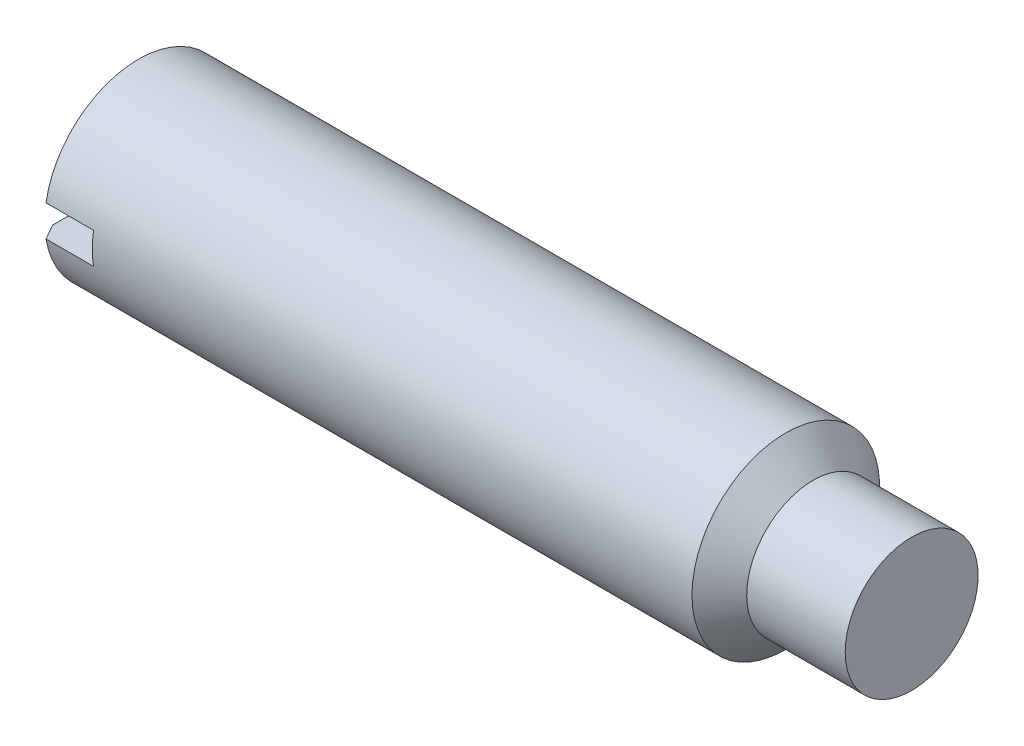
ISO-10303-21;
HEADER;
FILE_DESCRIPTION(('STEP AP214'),'2;1');
FILE_NAME('part.step','',(''),(''),'','','');
FILE_SCHEMA(('AUTOMOTIVE_DESIGN { 1 0 10303 214 1 1 1 1 }'));
ENDSEC;
DATA;
#1=APPLICATION_CONTEXT('core data for automotive mechanical design processes');
#2=APPLICATION_PROTOCOL_DEFINITION('international standard','automotive_design',2000,#1);
#3=PRODUCT_CONTEXT('',#1,'mechanical');
#4=PRODUCT('Part','Part','',(#3));
#5=PRODUCT_RELATED_PRODUCT_CATEGORY('part','',(#4));
#6=PRODUCT_DEFINITION_FORMATION('','',#4);
#7=PRODUCT_DEFINITION_CONTEXT('part definition',#1,'design');
#8=PRODUCT_DEFINITION('design','',#6,#7);
#9=PRODUCT_DEFINITION_SHAPE('','',#8);
#10=(LENGTH_UNIT() NAMED_UNIT(*) SI_UNIT(.MILLI.,.METRE.));
#11=(NAMED_UNIT(*) PLANE_ANGLE_UNIT() SI_UNIT($,.RADIAN.));
#12=(NAMED_UNIT(*) SI_UNIT($,.STERADIAN.) SOLID_ANGLE_UNIT());
#13=UNCERTAINTY_MEASURE_WITH_UNIT(LENGTH_MEASURE(1.E-05),#10,'distance_accuracy_value','');
#14=(GEOMETRIC_REPRESENTATION_CONTEXT(3) GLOBAL_UNCERTAINTY_ASSIGNED_CONTEXT((#13)) GLOBAL_UNIT_ASSIGNED_CONTEXT((#10,
#11,#12)) REPRESENTATION_CONTEXT('',''));
#15=CARTESIAN_POINT('',(0.,0.,0.));
#16=DIRECTION('',(0.,0.,1.));
#17=DIRECTION('',(1.,0.,0.));
#18=AXIS2_PLACEMENT_3D('',#15,#16,#17);
#19=CARTESIAN_POINT('',(0.,0.,0.));
#20=DIRECTION('',(-1.,0.,0.));
#21=DIRECTION('',(0.,0.,1.));
#22=AXIS2_PLACEMENT_3D('',#19,#20,#21);
#23=PLANE('',#22);
#24=CARTESIAN_POINT('',(0.,0.,0.));
#25=DIRECTION('',(-1.,0.,0.));
#26=DIRECTION('',(0.,0.,1.));
#27=AXIS2_PLACEMENT_3D('',#24,#25,#26);
#28=CIRCLE('',#27,5.036);
#29=CARTESIAN_POINT('',(0.,1.,4.93571636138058));
#30=VERTEX_POINT('',#29);
#31=CARTESIAN_POINT('',(0.,1.,-4.93571636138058));
#32=VERTEX_POINT('',#31);
#33=EDGE_CURVE('E114',#30,#32,#28,.T.);
#34=ORIENTED_EDGE('',*,*,#33,.T.);
#35=DIRECTION('',(0.,0.,1.));
#36=VECTOR('',#35,1.);
#37=CARTESIAN_POINT('',(0.,1.,-6.));
#38=LINE('',#37,#36);
#39=EDGE_CURVE('E188',#32,#30,#38,.T.);
#40=ORIENTED_EDGE('',*,*,#39,.T.);
#41=EDGE_LOOP('',(#34,#40));
#42=FACE_BOUND('',#41,.T.);
#43=ADVANCED_FACE('F41',(#42),#23,.T.);
#44=CARTESIAN_POINT('',(0.,-0.999999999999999,-4.93571636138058));
#45=VERTEX_POINT('',#44);
#46=CARTESIAN_POINT('',(0.,-1.,4.93571636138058));
#47=VERTEX_POINT('',#46);
#48=EDGE_CURVE('E110',#45,#47,#28,.T.);
#49=ORIENTED_EDGE('',*,*,#48,.T.);
#50=DIRECTION('',(0.,0.,-1.));
#51=VECTOR('',#50,1.);
#52=CARTESIAN_POINT('',(0.,-0.999999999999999,-6.));
#53=LINE('',#52,#51);
#54=EDGE_CURVE('E102',#47,#45,#53,.T.);
#55=ORIENTED_EDGE('',*,*,#54,.T.);
#56=EDGE_LOOP('',(#49,#55));
#57=FACE_BOUND('',#56,.T.);
#58=ADVANCED_FACE('F180',(#57),#23,.T.);
#59=CARTESIAN_POINT('',(0.,0.,0.));
#60=DIRECTION('',(1.,0.,0.));
#61=DIRECTION('',(0.,0.,-1.));
#62=AXIS2_PLACEMENT_3D('',#59,#60,#61);
#63=CONICAL_SURFACE('',#62,5.036,1.0471975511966);
#64=CARTESIAN_POINT('',(0.556565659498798,0.,0.));
#65=DIRECTION('',(-1.,0.,0.));
#66=DIRECTION('',(0.,0.,1.));
#67=AXIS2_PLACEMENT_3D('',#64,#65,#66);
#68=CIRCLE('',#67,6.);
#69=CARTESIAN_POINT('',(0.556565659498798,0.999999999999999,5.91607978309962));
#70=VERTEX_POINT('',#69);
#71=CARTESIAN_POINT('',(0.556565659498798,1.,-5.91607978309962));
#72=VERTEX_POINT('',#71);
#73=EDGE_CURVE('E107',#70,#72,#68,.T.);
#74=ORIENTED_EDGE('',*,*,#73,.T.);
#75=CARTESIAN_POINT('',(4.73989669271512,1.,-13.2079399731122));
#76=CARTESIAN_POINT('',(4.41853771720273,1.,-12.649708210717));
#77=CARTESIAN_POINT('',(4.09724308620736,1.,-12.0914392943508));
#78=CARTESIAN_POINT('',(3.45491866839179,1.,-10.9747439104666));
#79=CARTESIAN_POINT('',(3.13388888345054,1.,-10.416317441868));
#80=CARTESIAN_POINT('',(2.49197762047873,1.,-9.29878375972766));
#81=CARTESIAN_POINT('',(2.17109646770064,1.,-8.73967635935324));
#82=CARTESIAN_POINT('',(1.53002759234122,1.,-7.62106803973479));
#83=CARTESIAN_POINT('',(1.20983986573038,1.,-7.06156712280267));
#84=CARTESIAN_POINT('',(0.731752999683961,1.,-6.22374471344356));
#85=CARTESIAN_POINT('',(0.573331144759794,1.,-5.94572157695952));
#86=CARTESIAN_POINT('',(0.257006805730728,1.,-5.38937510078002));
#87=CARTESIAN_POINT('',(0.0991043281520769,1.,-5.11105175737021));
#88=CARTESIAN_POINT('',(-0.215803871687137,1.,-4.55405780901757));
#89=CARTESIAN_POINT('',(-0.37280995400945,1.,-4.27538740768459));
#90=CARTESIAN_POINT('',(-0.685421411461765,1.,-3.71727146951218));
#91=CARTESIAN_POINT('',(-0.841026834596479,1.,-3.4378259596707));
#92=CARTESIAN_POINT('',(-1.07280047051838,1.,-3.01670739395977));
#93=CARTESIAN_POINT('',(-1.15000341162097,1.,-2.87560489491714));
#94=CARTESIAN_POINT('',(-1.30334590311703,1.,-2.59280771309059));
#95=CARTESIAN_POINT('',(-1.37948536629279,1.,-2.45111298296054));
#96=CARTESIAN_POINT('',(-1.53019389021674,1.,-2.16666998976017));
#97=CARTESIAN_POINT('',(-1.60476099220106,1.,-2.02392068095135));
#98=CARTESIAN_POINT('',(-1.71445658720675,1.,-1.80870871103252));
#99=CARTESIAN_POINT('',(-1.75066016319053,1.,-1.73679509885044));
#100=CARTESIAN_POINT('',(-1.82208482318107,1.,-1.5924826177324));
#101=CARTESIAN_POINT('',(-1.85730593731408,1.,-1.52008376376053));
#102=CARTESIAN_POINT('',(-1.92735529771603,1.,-1.37261463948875));
#103=CARTESIAN_POINT('',(-1.96214530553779,1.,-1.2975261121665));
#104=CARTESIAN_POINT('',(-2.02965956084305,1.,-1.14642727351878));
#105=CARTESIAN_POINT('',(-2.06238404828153,1.,-1.07041707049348));
#106=CARTESIAN_POINT('',(-2.12476431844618,1.,-0.917145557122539));
#107=CARTESIAN_POINT('',(-2.15442052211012,1.,-0.839884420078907));
#108=CARTESIAN_POINT('',(-2.2090625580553,1.,-0.683706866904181));
#109=CARTESIAN_POINT('',(-2.23405029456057,1.,-0.604791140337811));
#110=CARTESIAN_POINT('',(-2.27018581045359,1.,-0.470093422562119));
#111=CARTESIAN_POINT('',(-2.28321589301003,1.,-0.414824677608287));
#112=CARTESIAN_POINT('',(-2.30494623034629,1.,-0.303453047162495));
#113=CARTESIAN_POINT('',(-2.31364920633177,1.,-0.24735070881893));
#114=CARTESIAN_POINT('',(-2.32581520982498,1.,-0.134957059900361));
#115=CARTESIAN_POINT('',(-2.3293144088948,1.,-0.0786698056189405));
#116=CARTESIAN_POINT('',(-2.33076867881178,1.,0.0339758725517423));
#117=CARTESIAN_POINT('',(-2.32872385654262,1.,0.0903342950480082));
#118=CARTESIAN_POINT('',(-2.31805799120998,1.,0.217768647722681));
#119=CARTESIAN_POINT('',(-2.30780921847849,1.,0.288706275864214));
#120=CARTESIAN_POINT('',(-2.28041448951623,1.,0.429255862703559));
#121=CARTESIAN_POINT('',(-2.26326048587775,1.,0.498866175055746));
#122=CARTESIAN_POINT('',(-2.23367324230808,1.,0.602653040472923));
#123=CARTESIAN_POINT('',(-2.22308279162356,1.,0.6373773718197));
#124=CARTESIAN_POINT('',(-2.20083833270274,1.,0.706460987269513));
#125=CARTESIAN_POINT('',(-2.18918499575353,1.,0.740820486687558));
#126=CARTESIAN_POINT('',(-2.16499431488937,1.,0.809218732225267));
#127=CARTESIAN_POINT('',(-2.15245710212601,1.,0.843257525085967));
#128=CARTESIAN_POINT('',(-2.12664333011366,1.,0.911058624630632));
#129=CARTESIAN_POINT('',(-2.11336665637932,1.,0.944820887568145));
#130=CARTESIAN_POINT('',(-2.06998388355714,1.,1.05227293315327));
#131=CARTESIAN_POINT('',(-2.03871498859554,1.,1.12549298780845));
#132=CARTESIAN_POINT('',(-1.97418773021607,1.,1.27105481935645));
#133=CARTESIAN_POINT('',(-1.94092900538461,1.,1.34339643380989));
#134=CARTESIAN_POINT('',(-1.87300145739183,1.,1.48745172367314));
#135=CARTESIAN_POINT('',(-1.83833201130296,1.,1.55916510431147));
#136=CARTESIAN_POINT('',(-1.76798292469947,1.,1.70209571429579));
#137=CARTESIAN_POINT('',(-1.73230324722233,1.,1.77331292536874));
#138=CARTESIAN_POINT('',(-1.62404833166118,1.,1.98662313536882));
#139=CARTESIAN_POINT('',(-1.55036430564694,1.,2.1281523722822));
#140=CARTESIAN_POINT('',(-1.40130813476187,1.,2.41025810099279));
#141=CARTESIAN_POINT('',(-1.32593649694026,1.,2.55083486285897));
#142=CARTESIAN_POINT('',(-1.17450983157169,1.,2.83063597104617));
#143=CARTESIAN_POINT('',(-1.09846071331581,1.,2.96986351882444));
#144=CARTESIAN_POINT('',(-0.945628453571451,1.,3.24792809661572));
#145=CARTESIAN_POINT('',(-0.868845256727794,1.,3.38676509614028));
#146=CARTESIAN_POINT('',(-0.637891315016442,1.,3.80258527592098));
#147=CARTESIAN_POINT('',(-0.482967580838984,1.,4.07914988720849));
#148=CARTESIAN_POINT('',(-0.119566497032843,1.,4.72494312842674));
#149=CARTESIAN_POINT('',(0.0893330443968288,0.999999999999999,5.09393352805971));
#150=CARTESIAN_POINT('',(0.508131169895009,0.999999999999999,5.83135176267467));
#151=CARTESIAN_POINT('',(0.718029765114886,0.999999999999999,6.19977959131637));
#152=CARTESIAN_POINT('',(1.13850339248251,0.999999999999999,6.93645171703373));
#153=CARTESIAN_POINT('',(1.34907866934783,0.999999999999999,7.30469587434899));
#154=CARTESIAN_POINT('',(1.77060223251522,0.999999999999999,8.0409687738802));
#155=CARTESIAN_POINT('',(1.98155051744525,0.999999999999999,8.40899751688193));
#156=CARTESIAN_POINT('',(2.40459995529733,0.999999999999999,9.14648067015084));
#157=CARTESIAN_POINT('',(2.61670218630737,0.999999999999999,9.51593446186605));
#158=CARTESIAN_POINT('',(3.04108596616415,0.999999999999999,10.2547396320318));
#159=CARTESIAN_POINT('',(3.25336751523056,0.999999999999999,10.6240910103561));
#160=CARTESIAN_POINT('',(3.67796813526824,0.999999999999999,11.3625576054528));
#161=CARTESIAN_POINT('',(3.8902871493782,0.999999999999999,11.7316728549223));
#162=CARTESIAN_POINT('',(4.3150247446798,0.999999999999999,12.4698454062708));
#163=CARTESIAN_POINT('',(4.52744332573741,0.999999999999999,12.8389027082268));
#164=CARTESIAN_POINT('',(4.73989669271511,0.999999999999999,13.2079399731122));
#165=B_SPLINE_CURVE_WITH_KNOTS('',3,(#75,#76,#77,#78,#79,#80,#81,#82,#83,#84,#85,#86,#87,#88,
#89,#90,#91,#92,#93,#94,#95,#96,#97,#98,#99,#100,#101,#102,#103,#104,#105,#106,#107,#108,#109,
#110,#111,#112,#113,#114,#115,#116,#117,#118,#119,#120,#121,#122,#123,#124,#125,#126,#127,#128,
#129,#130,#131,#132,#133,#134,#135,#136,#137,#138,#139,#140,#141,#142,#143,#144,#145,#146,#147,
#148,#149,#150,#151,#152,#153,#154,#155,#156,#157,#158,#159,#160,#161,#162,#163,#164),
.UNSPECIFIED.,.F.,.F.,(4,2,2,2,2,2,2,2,2,2,2,2,2,2,2,2,2,2,2,2,2,2,2,2,2,2,2,2,2,2,2,2,2,2,2,2,
2,2,2,2,2,2,2,2,4),(0.,1.93236881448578,3.86475122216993,5.79868288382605,7.73260327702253,
8.69257649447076,9.6525617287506,10.612129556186,11.5716643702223,12.054187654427,
12.5367502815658,13.0198822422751,13.2614145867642,13.5029395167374,13.7511887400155,
13.9994090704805,14.2475953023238,14.4956800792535,14.6658994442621,14.8360116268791,
15.0049357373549,15.1738565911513,15.3884236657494,15.6032415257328,15.7121389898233,
15.8209681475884,15.9297811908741,16.0386111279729,16.2774120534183,16.5162564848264,
16.7552075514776,16.9941673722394,17.4728272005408,17.9513450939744,18.4272722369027,
18.9032355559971,19.854231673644,21.1262890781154,22.3983607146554,23.6709606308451,
24.9435558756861,26.2215820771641,27.4996098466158,28.7770795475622,30.0545475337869),.UNSPECIFIED.);
#166=EDGE_CURVE('E135',#72,#32,#165,.T.);
#167=ORIENTED_EDGE('',*,*,#166,.T.);
#168=ORIENTED_EDGE('',*,*,#33,.F.);
#169=EDGE_CURVE('E137',#30,#70,#165,.T.);
#170=ORIENTED_EDGE('',*,*,#169,.T.);
#171=EDGE_LOOP('',(#74,#167,#168,#170));
#172=FACE_BOUND('',#171,.T.);
#173=ADVANCED_FACE('F152',(#172),#63,.T.);
#174=CARTESIAN_POINT('',(0.556565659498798,-0.999999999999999,-5.91607978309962));
#175=VERTEX_POINT('',#174);
#176=CARTESIAN_POINT('',(0.556565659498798,-1.,5.91607978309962));
#177=VERTEX_POINT('',#176);
#178=EDGE_CURVE('E111',#175,#177,#68,.T.);
#179=ORIENTED_EDGE('',*,*,#178,.T.);
#180=CARTESIAN_POINT('',(4.73989669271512,-1.,13.2079399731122));
#181=CARTESIAN_POINT('',(4.41853771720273,-1.,12.649708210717));
#182=CARTESIAN_POINT('',(4.09724308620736,-1.,12.0914392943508));
#183=CARTESIAN_POINT('',(3.45491866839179,-1.,10.9747439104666));
#184=CARTESIAN_POINT('',(3.13388888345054,-1.,10.416317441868));
#185=CARTESIAN_POINT('',(2.49197762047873,-1.,9.29878375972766));
#186=CARTESIAN_POINT('',(2.17109646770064,-1.,8.73967635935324));
#187=CARTESIAN_POINT('',(1.53002759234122,-1.,7.62106803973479));
#188=CARTESIAN_POINT('',(1.20983986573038,-1.,7.06156712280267));
#189=CARTESIAN_POINT('',(0.731752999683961,-1.,6.22374471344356));
#190=CARTESIAN_POINT('',(0.573331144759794,-1.,5.94572157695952));
#191=CARTESIAN_POINT('',(0.257006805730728,-1.,5.38937510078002));
#192=CARTESIAN_POINT('',(0.0991043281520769,-1.,5.11105175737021));
#193=CARTESIAN_POINT('',(-0.215803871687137,-1.,4.55405780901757));
#194=CARTESIAN_POINT('',(-0.37280995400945,-1.,4.27538740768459));
#195=CARTESIAN_POINT('',(-0.685421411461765,-1.,3.71727146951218));
#196=CARTESIAN_POINT('',(-0.841026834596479,-1.,3.4378259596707));
#197=CARTESIAN_POINT('',(-1.07280047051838,-1.,3.01670739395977));
#198=CARTESIAN_POINT('',(-1.15000341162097,-1.,2.87560489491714));
#199=CARTESIAN_POINT('',(-1.30334590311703,-1.,2.59280771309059));
#200=CARTESIAN_POINT('',(-1.37948536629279,-1.,2.45111298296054));
#201=CARTESIAN_POINT('',(-1.53019389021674,-1.,2.16666998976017));
#202=CARTESIAN_POINT('',(-1.60476099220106,-1.,2.02392068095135));
#203=CARTESIAN_POINT('',(-1.71445658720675,-1.,1.80870871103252));
#204=CARTESIAN_POINT('',(-1.75066016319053,-1.,1.73679509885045));
#205=CARTESIAN_POINT('',(-1.82208482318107,-1.,1.5924826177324));
#206=CARTESIAN_POINT('',(-1.85730593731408,-1.,1.52008376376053));
#207=CARTESIAN_POINT('',(-1.92735529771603,-1.,1.37261463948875));
#208=CARTESIAN_POINT('',(-1.96214530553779,-1.,1.2975261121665));
#209=CARTESIAN_POINT('',(-2.02965956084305,-1.,1.14642727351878));
#210=CARTESIAN_POINT('',(-2.06238404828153,-1.,1.07041707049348));
#211=CARTESIAN_POINT('',(-2.12476431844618,-1.,0.917145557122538));
#212=CARTESIAN_POINT('',(-2.15442052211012,-1.,0.839884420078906));
#213=CARTESIAN_POINT('',(-2.2090625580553,-1.,0.68370686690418));
#214=CARTESIAN_POINT('',(-2.23405029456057,-1.,0.604791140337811));
#215=CARTESIAN_POINT('',(-2.27018581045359,-1.,0.470093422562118));
#216=CARTESIAN_POINT('',(-2.28321589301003,-1.,0.414824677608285));
#217=CARTESIAN_POINT('',(-2.30494623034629,-1.,0.303453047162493));
#218=CARTESIAN_POINT('',(-2.31364920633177,-1.,0.247350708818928));
#219=CARTESIAN_POINT('',(-2.32581520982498,-1.,0.13495705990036));
#220=CARTESIAN_POINT('',(-2.3293144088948,-1.,0.0786698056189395));
#221=CARTESIAN_POINT('',(-2.33076867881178,-1.,-0.0339758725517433));
#222=CARTESIAN_POINT('',(-2.32872385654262,-1.,-0.0903342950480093));
#223=CARTESIAN_POINT('',(-2.31805799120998,-1.,-0.217768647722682));
#224=CARTESIAN_POINT('',(-2.30780921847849,-1.,-0.288706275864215));
#225=CARTESIAN_POINT('',(-2.28041448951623,-1.,-0.42925586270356));
#226=CARTESIAN_POINT('',(-2.26326048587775,-1.,-0.498866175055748));
#227=CARTESIAN_POINT('',(-2.23367324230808,-1.,-0.602653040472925));
#228=CARTESIAN_POINT('',(-2.22308279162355,-1.,-0.637377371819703));
#229=CARTESIAN_POINT('',(-2.20083833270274,-1.,-0.706460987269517));
#230=CARTESIAN_POINT('',(-2.18918499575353,-1.,-0.740820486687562));
#231=CARTESIAN_POINT('',(-2.16499431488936,-1.,-0.809218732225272));
#232=CARTESIAN_POINT('',(-2.15245710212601,-1.,-0.843257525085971));
#233=CARTESIAN_POINT('',(-2.12664333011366,-1.,-0.911058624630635));
#234=CARTESIAN_POINT('',(-2.11336665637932,-1.,-0.944820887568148));
#235=CARTESIAN_POINT('',(-2.06998388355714,-1.,-1.05227293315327));
#236=CARTESIAN_POINT('',(-2.03871498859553,-1.,-1.12549298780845));
#237=CARTESIAN_POINT('',(-1.97418773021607,-1.,-1.27105481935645));
#238=CARTESIAN_POINT('',(-1.94092900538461,-1.,-1.34339643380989));
#239=CARTESIAN_POINT('',(-1.87300145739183,-1.,-1.48745172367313));
#240=CARTESIAN_POINT('',(-1.83833201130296,-1.,-1.55916510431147));
#241=CARTESIAN_POINT('',(-1.76798292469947,-1.,-1.70209571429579));
#242=CARTESIAN_POINT('',(-1.73230324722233,-1.,-1.77331292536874));
#243=CARTESIAN_POINT('',(-1.62404833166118,-1.,-1.98662313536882));
#244=CARTESIAN_POINT('',(-1.55036430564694,-1.,-2.1281523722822));
#245=CARTESIAN_POINT('',(-1.40130813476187,-1.,-2.41025810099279));
#246=CARTESIAN_POINT('',(-1.32593649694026,-1.,-2.55083486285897));
#247=CARTESIAN_POINT('',(-1.17450983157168,-1.,-2.83063597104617));
#248=CARTESIAN_POINT('',(-1.09846071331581,-1.,-2.96986351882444));
#249=CARTESIAN_POINT('',(-0.945628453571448,-1.,-3.24792809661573));
#250=CARTESIAN_POINT('',(-0.868845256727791,-1.,-3.38676509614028));
#251=CARTESIAN_POINT('',(-0.637891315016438,-0.999999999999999,-3.80258527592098));
#252=CARTESIAN_POINT('',(-0.48296758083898,-1.,-4.0791498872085));
#253=CARTESIAN_POINT('',(-0.119566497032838,-1.,-4.72494312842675));
#254=CARTESIAN_POINT('',(0.0893330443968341,-0.999999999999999,-5.09393352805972));
#255=CARTESIAN_POINT('',(0.508131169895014,-0.999999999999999,-5.83135176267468));
#256=CARTESIAN_POINT('',(0.718029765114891,-0.999999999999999,-6.19977959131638));
#257=CARTESIAN_POINT('',(1.13850339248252,-0.999999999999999,-6.93645171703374));
#258=CARTESIAN_POINT('',(1.34907866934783,-0.999999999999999,-7.30469587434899));
#259=CARTESIAN_POINT('',(1.77060223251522,-0.999999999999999,-8.04096877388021));
#260=CARTESIAN_POINT('',(1.98155051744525,-0.999999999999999,-8.40899751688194));
#261=CARTESIAN_POINT('',(2.40459995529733,-0.999999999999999,-9.14648067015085));
#262=CARTESIAN_POINT('',(2.61670218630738,-0.999999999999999,-9.51593446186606));
#263=CARTESIAN_POINT('',(3.04108596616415,-0.999999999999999,-10.2547396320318));
#264=CARTESIAN_POINT('',(3.25336751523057,-0.999999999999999,-10.6240910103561));
#265=CARTESIAN_POINT('',(3.67796813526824,-0.999999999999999,-11.3625576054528));
#266=CARTESIAN_POINT('',(3.8902871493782,-0.999999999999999,-11.7316728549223));
#267=CARTESIAN_POINT('',(4.31502474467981,-0.999999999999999,-12.4698454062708));
#268=CARTESIAN_POINT('',(4.52744332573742,-0.999999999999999,-12.8389027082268));
#269=CARTESIAN_POINT('',(4.73989669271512,-0.999999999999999,-13.2079399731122));
#270=B_SPLINE_CURVE_WITH_KNOTS('',3,(#180,#181,#182,#183,#184,#185,#186,#187,#188,#189,#190,
#191,#192,#193,#194,#195,#196,#197,#198,#199,#200,#201,#202,#203,#204,#205,#206,#207,#208,#209,
#210,#211,#212,#213,#214,#215,#216,#217,#218,#219,#220,#221,#222,#223,#224,#225,#226,#227,#228,
#229,#230,#231,#232,#233,#234,#235,#236,#237,#238,#239,#240,#241,#242,#243,#244,#245,#246,#247,
#248,#249,#250,#251,#252,#253,#254,#255,#256,#257,#258,#259,#260,#261,#262,#263,#264,#265,#266,
#267,#268,#269),.UNSPECIFIED.,.F.,.F.,(4,2,2,2,2,2,2,2,2,2,2,2,2,2,2,2,2,2,2,2,2,2,2,2,2,2,2,2,
2,2,2,2,2,2,2,2,2,2,2,2,2,2,2,2,4),(0.,1.93236881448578,3.86475122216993,5.79868288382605,
7.73260327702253,8.69257649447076,9.6525617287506,10.612129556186,11.5716643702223,
12.054187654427,12.5367502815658,13.0198822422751,13.2614145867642,13.5029395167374,
13.7511887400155,13.9994090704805,14.2475953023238,14.4956800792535,14.6658994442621,
14.8360116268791,15.0049357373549,15.1738565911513,15.3884236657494,15.6032415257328,
15.7121389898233,15.8209681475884,15.9297811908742,16.0386111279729,16.2774120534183,
16.5162564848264,16.7552075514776,16.9941673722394,17.4728272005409,17.9513450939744,
18.4272722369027,18.9032355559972,19.8542316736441,21.1262890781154,22.3983607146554,
23.6709606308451,24.9435558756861,26.2215820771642,27.4996098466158,28.7770795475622,
30.0545475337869),.UNSPECIFIED.);
#271=EDGE_CURVE('E132',#177,#47,#270,.T.);
#272=ORIENTED_EDGE('',*,*,#271,.T.);
#273=ORIENTED_EDGE('',*,*,#48,.F.);
#274=EDGE_CURVE('E133',#45,#175,#270,.T.);
#275=ORIENTED_EDGE('',*,*,#274,.T.);
#276=EDGE_LOOP('',(#179,#272,#273,#275));
#277=FACE_BOUND('',#276,.T.);
#278=ADVANCED_FACE('F130',(#277),#63,.T.);
#279=CARTESIAN_POINT('',(-12.7,0.,0.));
#280=DIRECTION('',(-1.,0.,0.));
#281=DIRECTION('',(0.,0.,1.));
#282=AXIS2_PLACEMENT_3D('',#279,#280,#281);
#283=CYLINDRICAL_SURFACE('',#282,6.);
#284=CARTESIAN_POINT('',(41.95,0.,0.));
#285=DIRECTION('',(-1.,0.,0.));
#286=DIRECTION('',(0.,0.,1.));
#287=AXIS2_PLACEMENT_3D('',#284,#285,#286);
#288=CIRCLE('',#287,6.);
#289=CARTESIAN_POINT('',(41.95,0.,6.));
#290=VERTEX_POINT('',#289);
#291=EDGE_CURVE('E117',#290,#290,#288,.T.);
#292=ORIENTED_EDGE('',*,*,#291,.T.);
#293=EDGE_LOOP('',(#292));
#294=FACE_BOUND('',#293,.T.);
#295=ORIENTED_EDGE('',*,*,#73,.F.);
#296=DIRECTION('',(-1.,0.,0.));
#297=VECTOR('',#296,1.);
#298=CARTESIAN_POINT('',(-12.7,0.999999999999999,5.91607978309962));
#299=LINE('',#298,#297);
#300=CARTESIAN_POINT('',(3.6,0.999999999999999,5.91607978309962));
#301=VERTEX_POINT('',#300);
#302=EDGE_CURVE('E11',#70,#301,#299,.F.);
#303=ORIENTED_EDGE('',*,*,#302,.T.);
#304=CARTESIAN_POINT('',(3.6,0.,0.));
#305=DIRECTION('',(1.,0.,0.));
#306=DIRECTION('',(0.,0.,-1.));
#307=AXIS2_PLACEMENT_3D('',#304,#305,#306);
#308=CIRCLE('',#307,6.);
#309=CARTESIAN_POINT('',(3.6,-1.,5.91607978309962));
#310=VERTEX_POINT('',#309);
#311=EDGE_CURVE('E89',#310,#301,#308,.F.);
#312=ORIENTED_EDGE('',*,*,#311,.F.);
#313=DIRECTION('',(-1.,0.,0.));
#314=VECTOR('',#313,1.);
#315=CARTESIAN_POINT('',(-12.7,-1.,5.91607978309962));
#316=LINE('',#315,#314);
#317=EDGE_CURVE('E48',#310,#177,#316,.T.);
#318=ORIENTED_EDGE('',*,*,#317,.T.);
#319=ORIENTED_EDGE('',*,*,#178,.F.);
#320=DIRECTION('',(-1.,0.,0.));
#321=VECTOR('',#320,1.);
#322=CARTESIAN_POINT('',(-12.7,-0.999999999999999,-5.91607978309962));
#323=LINE('',#322,#321);
#324=CARTESIAN_POINT('',(3.6,-0.999999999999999,-5.91607978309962));
#325=VERTEX_POINT('',#324);
#326=EDGE_CURVE('E122',#175,#325,#323,.F.);
#327=ORIENTED_EDGE('',*,*,#326,.T.);
#328=CARTESIAN_POINT('',(3.6,1.,-5.91607978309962));
#329=VERTEX_POINT('',#328);
#330=EDGE_CURVE('E98',#329,#325,#308,.F.);
#331=ORIENTED_EDGE('',*,*,#330,.F.);
#332=DIRECTION('',(-1.,0.,0.));
#333=VECTOR('',#332,1.);
#334=CARTESIAN_POINT('',(-12.7,1.,-5.91607978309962));
#335=LINE('',#334,#333);
#336=EDGE_CURVE('E96',#329,#72,#335,.T.);
#337=ORIENTED_EDGE('',*,*,#336,.T.);
#338=EDGE_LOOP('',(#295,#303,#312,#318,#319,#327,#331,#337));
#339=FACE_BOUND('',#338,.T.);
#340=ADVANCED_FACE('F105',(#294,#339),#283,.T.);
#341=CARTESIAN_POINT('',(43.7,0.,0.));
#342=DIRECTION('',(-1.,0.,0.));
#343=DIRECTION('',(0.,0.,1.));
#344=AXIS2_PLACEMENT_3D('',#341,#342,#343);
#345=CONICAL_SURFACE('',#344,4.25,0.785398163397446);
#346=ORIENTED_EDGE('',*,*,#291,.F.);
#347=EDGE_LOOP('',(#346));
#348=FACE_BOUND('',#347,.T.);
#349=CARTESIAN_POINT('',(43.7,0.,0.));
#350=DIRECTION('',(-1.,0.,0.));
#351=DIRECTION('',(0.,0.,1.));
#352=AXIS2_PLACEMENT_3D('',#349,#350,#351);
#353=CIRCLE('',#352,4.25);
#354=CARTESIAN_POINT('',(43.7,0.,4.25));
#355=VERTEX_POINT('',#354);
#356=EDGE_CURVE('E192',#355,#355,#353,.T.);
#357=ORIENTED_EDGE('',*,*,#356,.T.);
#358=EDGE_LOOP('',(#357));
#359=FACE_BOUND('',#358,.T.);
#360=ADVANCED_FACE('F169',(#348,#359),#345,.T.);
#361=CARTESIAN_POINT('',(-12.7,0.,0.));
#362=DIRECTION('',(-1.,0.,0.));
#363=DIRECTION('',(0.,0.,1.));
#364=AXIS2_PLACEMENT_3D('',#361,#362,#363);
#365=CYLINDRICAL_SURFACE('',#364,4.25);
#366=CARTESIAN_POINT('',(50.,0.,0.));
#367=DIRECTION('',(-1.,0.,0.));
#368=DIRECTION('',(0.,0.,1.));
#369=AXIS2_PLACEMENT_3D('',#366,#367,#368);
#370=CIRCLE('',#369,4.25);
#371=CARTESIAN_POINT('',(50.,0.,4.25));
#372=VERTEX_POINT('',#371);
#373=EDGE_CURVE('E190',#372,#372,#370,.T.);
#374=ORIENTED_EDGE('',*,*,#373,.T.);
#375=EDGE_LOOP('',(#374));
#376=FACE_BOUND('',#375,.T.);
#377=ORIENTED_EDGE('',*,*,#356,.F.);
#378=EDGE_LOOP('',(#377));
#379=FACE_BOUND('',#378,.T.);
#380=ADVANCED_FACE('F165',(#376,#379),#365,.T.);
#381=CARTESIAN_POINT('',(50.,4.25,0.));
#382=DIRECTION('',(1.,0.,0.));
#383=DIRECTION('',(0.,0.,-1.));
#384=AXIS2_PLACEMENT_3D('',#381,#382,#383);
#385=PLANE('',#384);
#386=ORIENTED_EDGE('',*,*,#373,.F.);
#387=EDGE_LOOP('',(#386));
#388=FACE_BOUND('',#387,.T.);
#389=ADVANCED_FACE('F162',(#388),#385,.T.);
#390=CARTESIAN_POINT('',(3.6,1.,-6.));
#391=DIRECTION('',(0.,-1.,0.));
#392=DIRECTION('',(0.,0.,-1.));
#393=AXIS2_PLACEMENT_3D('',#390,#391,#392);
#394=PLANE('',#393);
#395=ORIENTED_EDGE('',*,*,#39,.F.);
#396=ORIENTED_EDGE('',*,*,#166,.F.);
#397=ORIENTED_EDGE('',*,*,#336,.F.);
#398=DIRECTION('',(0.,0.,1.));
#399=VECTOR('',#398,1.);
#400=CARTESIAN_POINT('',(3.6,1.,-6.));
#401=LINE('',#400,#399);
#402=EDGE_CURVE('E55',#329,#301,#401,.T.);
#403=ORIENTED_EDGE('',*,*,#402,.T.);
#404=ORIENTED_EDGE('',*,*,#302,.F.);
#405=ORIENTED_EDGE('',*,*,#169,.F.);
#406=EDGE_LOOP('',(#395,#396,#397,#403,#404,#405));
#407=FACE_BOUND('',#406,.T.);
#408=ADVANCED_FACE('F99',(#407),#394,.T.);
#409=CARTESIAN_POINT('',(3.6,-0.999999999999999,-6.));
#410=DIRECTION('',(0.,1.,0.));
#411=DIRECTION('',(0.,0.,1.));
#412=AXIS2_PLACEMENT_3D('',#409,#410,#411);
#413=PLANE('',#412);
#414=ORIENTED_EDGE('',*,*,#54,.F.);
#415=ORIENTED_EDGE('',*,*,#271,.F.);
#416=ORIENTED_EDGE('',*,*,#317,.F.);
#417=DIRECTION('',(0.,0.,-1.));
#418=VECTOR('',#417,1.);
#419=CARTESIAN_POINT('',(3.6,-0.999999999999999,-6.));
#420=LINE('',#419,#418);
#421=EDGE_CURVE('E92',#310,#325,#420,.T.);
#422=ORIENTED_EDGE('',*,*,#421,.T.);
#423=ORIENTED_EDGE('',*,*,#326,.F.);
#424=ORIENTED_EDGE('',*,*,#274,.F.);
#425=EDGE_LOOP('',(#414,#415,#416,#422,#423,#424));
#426=FACE_BOUND('',#425,.T.);
#427=ADVANCED_FACE('F155',(#426),#413,.T.);
#428=CARTESIAN_POINT('',(3.6,1.,-6.));
#429=DIRECTION('',(1.,0.,0.));
#430=DIRECTION('',(0.,0.,-1.));
#431=AXIS2_PLACEMENT_3D('',#428,#429,#430);
#432=PLANE('',#431);
#433=ORIENTED_EDGE('',*,*,#421,.F.);
#434=ORIENTED_EDGE('',*,*,#311,.T.);
#435=ORIENTED_EDGE('',*,*,#402,.F.);
#436=ORIENTED_EDGE('',*,*,#330,.T.);
#437=EDGE_LOOP('',(#433,#434,#435,#436));
#438=FACE_BOUND('',#437,.T.);
#439=ADVANCED_FACE('F90',(#438),#432,.F.);
#440=CLOSED_SHELL('',(#43,#58,#173,#278,#340,#360,#380,#389,#408,#427,#439));
#441=MANIFOLD_SOLID_BREP('B2',#440);
#442=ADVANCED_BREP_SHAPE_REPRESENTATION('',(#18,#441),#14);
#443=SHAPE_DEFINITION_REPRESENTATION(#9,#442);
ENDSEC;
END-ISO-10303-21;
